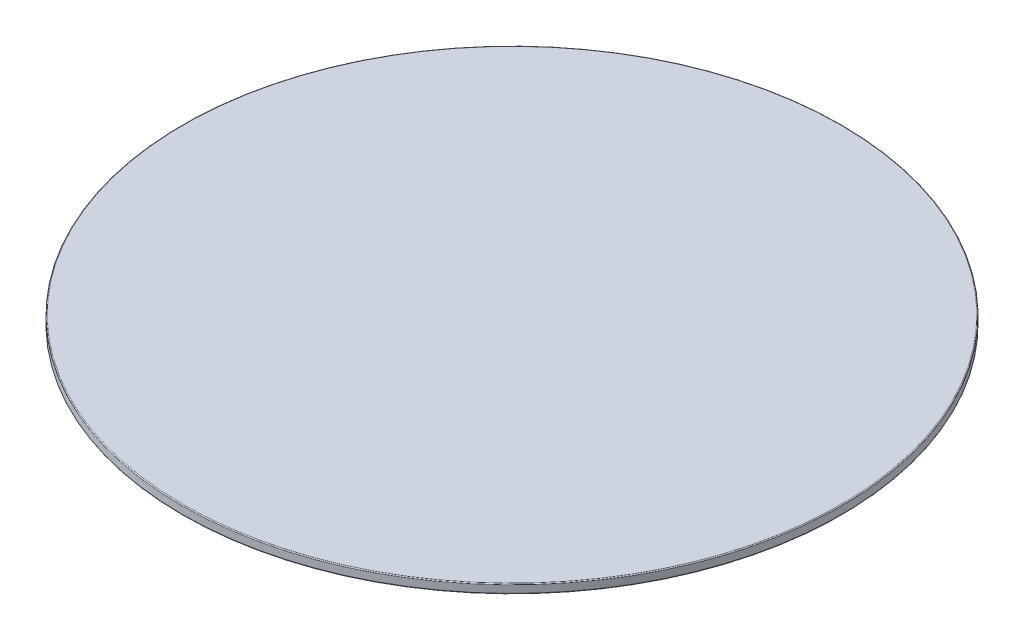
ISO-10303-21;
HEADER;
FILE_DESCRIPTION(('STEP AP214'),'2;1');
FILE_NAME('part.step','',(''),(''),'','','');
FILE_SCHEMA(('AUTOMOTIVE_DESIGN { 1 0 10303 214 1 1 1 1 }'));
ENDSEC;
DATA;
#1=APPLICATION_CONTEXT('core data for automotive mechanical design processes');
#2=APPLICATION_PROTOCOL_DEFINITION('international standard','automotive_design',2000,#1);
#3=PRODUCT_CONTEXT('',#1,'mechanical');
#4=PRODUCT('Part','Part','',(#3));
#5=PRODUCT_RELATED_PRODUCT_CATEGORY('part','',(#4));
#6=PRODUCT_DEFINITION_FORMATION('','',#4);
#7=PRODUCT_DEFINITION_CONTEXT('part definition',#1,'design');
#8=PRODUCT_DEFINITION('design','',#6,#7);
#9=PRODUCT_DEFINITION_SHAPE('','',#8);
#10=(LENGTH_UNIT() NAMED_UNIT(*) SI_UNIT(.MILLI.,.METRE.));
#11=(NAMED_UNIT(*) PLANE_ANGLE_UNIT() SI_UNIT($,.RADIAN.));
#12=(NAMED_UNIT(*) SI_UNIT($,.STERADIAN.) SOLID_ANGLE_UNIT());
#13=UNCERTAINTY_MEASURE_WITH_UNIT(LENGTH_MEASURE(1.E-05),#10,'distance_accuracy_value','');
#14=(GEOMETRIC_REPRESENTATION_CONTEXT(3) GLOBAL_UNCERTAINTY_ASSIGNED_CONTEXT((#13)) GLOBAL_UNIT_ASSIGNED_CONTEXT((#10,
#11,#12)) REPRESENTATION_CONTEXT('',''));
#15=CARTESIAN_POINT('',(0.,0.,0.));
#16=DIRECTION('',(0.,0.,1.));
#17=DIRECTION('',(1.,0.,0.));
#18=AXIS2_PLACEMENT_3D('',#15,#16,#17);
#19=CARTESIAN_POINT('',(0.,2.,0.));
#20=DIRECTION('',(0.,-1.,0.));
#21=DIRECTION('',(0.,0.,-1.));
#22=AXIS2_PLACEMENT_3D('',#19,#20,#21);
#23=CYLINDRICAL_SURFACE('',#22,72.5);
#24=CARTESIAN_POINT('',(0.,0.2,0.));
#25=DIRECTION('',(0.,1.,0.));
#26=DIRECTION('',(0.,0.,1.));
#27=AXIS2_PLACEMENT_3D('',#24,#25,#26);
#28=CIRCLE('',#27,72.5);
#29=CARTESIAN_POINT('',(0.,0.2,72.5));
#30=VERTEX_POINT('',#29);
#31=EDGE_CURVE('E66',#30,#30,#28,.T.);
#32=ORIENTED_EDGE('',*,*,#31,.T.);
#33=EDGE_LOOP('',(#32));
#34=FACE_BOUND('',#33,.T.);
#35=CARTESIAN_POINT('',(0.,1.8,0.));
#36=DIRECTION('',(0.,1.,0.));
#37=DIRECTION('',(0.,0.,1.));
#38=AXIS2_PLACEMENT_3D('',#35,#36,#37);
#39=CIRCLE('',#38,72.5);
#40=CARTESIAN_POINT('',(0.,1.8,72.5));
#41=VERTEX_POINT('',#40);
#42=EDGE_CURVE('E69',#41,#41,#39,.F.);
#43=ORIENTED_EDGE('',*,*,#42,.T.);
#44=EDGE_LOOP('',(#43));
#45=FACE_BOUND('',#44,.T.);
#46=ADVANCED_FACE('F34',(#34,#45),#23,.T.);
#47=CARTESIAN_POINT('',(0.,2.,0.));
#48=DIRECTION('',(0.,1.,0.));
#49=DIRECTION('',(0.,0.,1.));
#50=AXIS2_PLACEMENT_3D('',#47,#48,#49);
#51=PLANE('',#50);
#52=CARTESIAN_POINT('',(0.,2.,0.));
#53=DIRECTION('',(0.,1.,0.));
#54=DIRECTION('',(0.,0.,1.));
#55=AXIS2_PLACEMENT_3D('',#52,#53,#54);
#56=CIRCLE('',#55,72.3);
#57=CARTESIAN_POINT('',(0.,2.,72.3));
#58=VERTEX_POINT('',#57);
#59=EDGE_CURVE('E60',#58,#58,#56,.T.);
#60=ORIENTED_EDGE('',*,*,#59,.T.);
#61=EDGE_LOOP('',(#60));
#62=FACE_BOUND('',#61,.T.);
#63=ADVANCED_FACE('F96',(#62),#51,.T.);
#64=CARTESIAN_POINT('',(0.,0.,0.));
#65=DIRECTION('',(0.,1.,0.));
#66=DIRECTION('',(0.,0.,1.));
#67=AXIS2_PLACEMENT_3D('',#64,#65,#66);
#68=PLANE('',#67);
#69=CARTESIAN_POINT('',(0.,0.,0.));
#70=DIRECTION('',(0.,1.,0.));
#71=DIRECTION('',(0.,0.,1.));
#72=AXIS2_PLACEMENT_3D('',#69,#70,#71);
#73=CIRCLE('',#72,11.2);
#74=CARTESIAN_POINT('',(0.,0.,11.2));
#75=VERTEX_POINT('',#74);
#76=EDGE_CURVE('E49',#75,#75,#73,.T.);
#77=ORIENTED_EDGE('',*,*,#76,.T.);
#78=EDGE_LOOP('',(#77));
#79=FACE_BOUND('',#78,.T.);
#80=CARTESIAN_POINT('',(0.,0.,0.));
#81=DIRECTION('',(0.,1.,0.));
#82=DIRECTION('',(0.,0.,1.));
#83=AXIS2_PLACEMENT_3D('',#80,#81,#82);
#84=CIRCLE('',#83,72.3);
#85=CARTESIAN_POINT('',(0.,0.,72.3));
#86=VERTEX_POINT('',#85);
#87=EDGE_CURVE('E63',#86,#86,#84,.F.);
#88=ORIENTED_EDGE('',*,*,#87,.T.);
#89=EDGE_LOOP('',(#88));
#90=FACE_BOUND('',#89,.T.);
#91=ADVANCED_FACE('F102',(#79,#90),#68,.F.);
#92=CARTESIAN_POINT('',(0.,0.2,0.));
#93=DIRECTION('',(0.,1.,0.));
#94=DIRECTION('',(0.,0.,1.));
#95=AXIS2_PLACEMENT_3D('',#92,#93,#94);
#96=TOROIDAL_SURFACE('',#95,72.3,0.2);
#97=ORIENTED_EDGE('',*,*,#87,.F.);
#98=EDGE_LOOP('',(#97));
#99=FACE_BOUND('',#98,.T.);
#100=ORIENTED_EDGE('',*,*,#31,.F.);
#101=EDGE_LOOP('',(#100));
#102=FACE_BOUND('',#101,.T.);
#103=ADVANCED_FACE('F91',(#99,#102),#96,.T.);
#104=CARTESIAN_POINT('',(0.,1.8,0.));
#105=DIRECTION('',(0.,1.,0.));
#106=DIRECTION('',(0.,0.,1.));
#107=AXIS2_PLACEMENT_3D('',#104,#105,#106);
#108=TOROIDAL_SURFACE('',#107,72.3,0.2);
#109=ORIENTED_EDGE('',*,*,#42,.F.);
#110=EDGE_LOOP('',(#109));
#111=FACE_BOUND('',#110,.T.);
#112=ORIENTED_EDGE('',*,*,#59,.F.);
#113=EDGE_LOOP('',(#112));
#114=FACE_BOUND('',#113,.T.);
#115=ADVANCED_FACE('F81',(#111,#114),#108,.T.);
#116=CARTESIAN_POINT('',(0.,-4.,0.));
#117=DIRECTION('',(0.,1.,0.));
#118=DIRECTION('',(0.,0.,1.));
#119=AXIS2_PLACEMENT_3D('',#116,#117,#118);
#120=CYLINDRICAL_SURFACE('',#119,7.5);
#121=CARTESIAN_POINT('',(0.,-3.8,0.));
#122=DIRECTION('',(0.,-1.,0.));
#123=DIRECTION('',(0.,0.,-1.));
#124=AXIS2_PLACEMENT_3D('',#121,#122,#123);
#125=CIRCLE('',#124,7.5);
#126=CARTESIAN_POINT('',(0.,-3.8,-7.5));
#127=VERTEX_POINT('',#126);
#128=EDGE_CURVE('E45',#127,#127,#125,.T.);
#129=ORIENTED_EDGE('',*,*,#128,.T.);
#130=EDGE_LOOP('',(#129));
#131=FACE_BOUND('',#130,.T.);
#132=CARTESIAN_POINT('',(0.,0.,0.));
#133=DIRECTION('',(0.,-1.,0.));
#134=DIRECTION('',(0.,0.,-1.));
#135=AXIS2_PLACEMENT_3D('',#132,#133,#134);
#136=CIRCLE('',#135,7.5);
#137=CARTESIAN_POINT('',(0.,0.,-7.5));
#138=VERTEX_POINT('',#137);
#139=EDGE_CURVE('E72',#138,#138,#136,.T.);
#140=ORIENTED_EDGE('',*,*,#139,.F.);
#141=EDGE_LOOP('',(#140));
#142=FACE_BOUND('',#141,.T.);
#143=ADVANCED_FACE('F78',(#131,#142),#120,.F.);
#144=CARTESIAN_POINT('',(0.,-4.,0.));
#145=DIRECTION('',(0.,1.,0.));
#146=DIRECTION('',(0.,0.,1.));
#147=AXIS2_PLACEMENT_3D('',#144,#145,#146);
#148=CYLINDRICAL_SURFACE('',#147,11.);
#149=CARTESIAN_POINT('',(0.,-0.2,0.));
#150=DIRECTION('',(0.,1.,0.));
#151=DIRECTION('',(0.,0.,1.));
#152=AXIS2_PLACEMENT_3D('',#149,#150,#151);
#153=CIRCLE('',#152,11.);
#154=CARTESIAN_POINT('',(0.,-0.2,11.));
#155=VERTEX_POINT('',#154);
#156=EDGE_CURVE('E54',#155,#155,#153,.F.);
#157=ORIENTED_EDGE('',*,*,#156,.T.);
#158=EDGE_LOOP('',(#157));
#159=FACE_BOUND('',#158,.T.);
#160=CARTESIAN_POINT('',(0.,-3.8,0.));
#161=DIRECTION('',(0.,-1.,0.));
#162=DIRECTION('',(0.,0.,-1.));
#163=AXIS2_PLACEMENT_3D('',#160,#161,#162);
#164=CIRCLE('',#163,11.);
#165=CARTESIAN_POINT('',(0.,-3.8,-11.));
#166=VERTEX_POINT('',#165);
#167=EDGE_CURVE('E57',#166,#166,#164,.F.);
#168=ORIENTED_EDGE('',*,*,#167,.T.);
#169=EDGE_LOOP('',(#168));
#170=FACE_BOUND('',#169,.T.);
#171=ADVANCED_FACE('F80',(#159,#170),#148,.T.);
#172=CARTESIAN_POINT('',(0.,-4.,0.));
#173=DIRECTION('',(0.,-1.,0.));
#174=DIRECTION('',(0.,0.,-1.));
#175=AXIS2_PLACEMENT_3D('',#172,#173,#174);
#176=PLANE('',#175);
#177=CARTESIAN_POINT('',(0.,-4.,0.));
#178=DIRECTION('',(0.,-1.,0.));
#179=DIRECTION('',(0.,0.,-1.));
#180=AXIS2_PLACEMENT_3D('',#177,#178,#179);
#181=CIRCLE('',#180,7.7);
#182=CARTESIAN_POINT('',(0.,-4.,-7.7));
#183=VERTEX_POINT('',#182);
#184=EDGE_CURVE('E10',#183,#183,#181,.F.);
#185=ORIENTED_EDGE('',*,*,#184,.T.);
#186=EDGE_LOOP('',(#185));
#187=FACE_BOUND('',#186,.T.);
#188=CARTESIAN_POINT('',(0.,-4.,0.));
#189=DIRECTION('',(0.,-1.,0.));
#190=DIRECTION('',(0.,0.,-1.));
#191=AXIS2_PLACEMENT_3D('',#188,#189,#190);
#192=CIRCLE('',#191,10.8);
#193=CARTESIAN_POINT('',(0.,-4.,-10.8));
#194=VERTEX_POINT('',#193);
#195=EDGE_CURVE('E41',#194,#194,#192,.T.);
#196=ORIENTED_EDGE('',*,*,#195,.T.);
#197=EDGE_LOOP('',(#196));
#198=FACE_BOUND('',#197,.T.);
#199=ADVANCED_FACE('F88',(#187,#198),#176,.T.);
#200=ORIENTED_EDGE('',*,*,#139,.T.);
#201=EDGE_LOOP('',(#200));
#202=FACE_BOUND('',#201,.T.);
#203=ADVANCED_FACE('F76',(#202),#68,.F.);
#204=CARTESIAN_POINT('',(0.,-0.2,0.));
#205=DIRECTION('',(0.,1.,0.));
#206=DIRECTION('',(0.,0.,1.));
#207=AXIS2_PLACEMENT_3D('',#204,#205,#206);
#208=TOROIDAL_SURFACE('',#207,11.2,0.2);
#209=ORIENTED_EDGE('',*,*,#76,.F.);
#210=EDGE_LOOP('',(#209));
#211=FACE_BOUND('',#210,.T.);
#212=ORIENTED_EDGE('',*,*,#156,.F.);
#213=EDGE_LOOP('',(#212));
#214=FACE_BOUND('',#213,.T.);
#215=ADVANCED_FACE('F110',(#211,#214),#208,.F.);
#216=CARTESIAN_POINT('',(0.,-3.8,0.));
#217=DIRECTION('',(0.,-1.,0.));
#218=DIRECTION('',(0.,0.,-1.));
#219=AXIS2_PLACEMENT_3D('',#216,#217,#218);
#220=TOROIDAL_SURFACE('',#219,7.7,0.2);
#221=ORIENTED_EDGE('',*,*,#184,.F.);
#222=EDGE_LOOP('',(#221));
#223=FACE_BOUND('',#222,.T.);
#224=ORIENTED_EDGE('',*,*,#128,.F.);
#225=EDGE_LOOP('',(#224));
#226=FACE_BOUND('',#225,.T.);
#227=ADVANCED_FACE('F112',(#223,#226),#220,.T.);
#228=CARTESIAN_POINT('',(0.,-3.8,0.));
#229=DIRECTION('',(0.,-1.,0.));
#230=DIRECTION('',(0.,0.,-1.));
#231=AXIS2_PLACEMENT_3D('',#228,#229,#230);
#232=TOROIDAL_SURFACE('',#231,10.8,0.2);
#233=ORIENTED_EDGE('',*,*,#167,.F.);
#234=EDGE_LOOP('',(#233));
#235=FACE_BOUND('',#234,.T.);
#236=ORIENTED_EDGE('',*,*,#195,.F.);
#237=EDGE_LOOP('',(#236));
#238=FACE_BOUND('',#237,.T.);
#239=ADVANCED_FACE('F36',(#235,#238),#232,.T.);
#240=CLOSED_SHELL('',(#46,#63,#91,#103,#115,#143,#171,#199,#203,#215,#227,#239));
#241=MANIFOLD_SOLID_BREP('B2',#240);
#242=ADVANCED_BREP_SHAPE_REPRESENTATION('',(#18,#241),#14);
#243=SHAPE_DEFINITION_REPRESENTATION(#9,#242);
ENDSEC;
END-ISO-10303-21;
